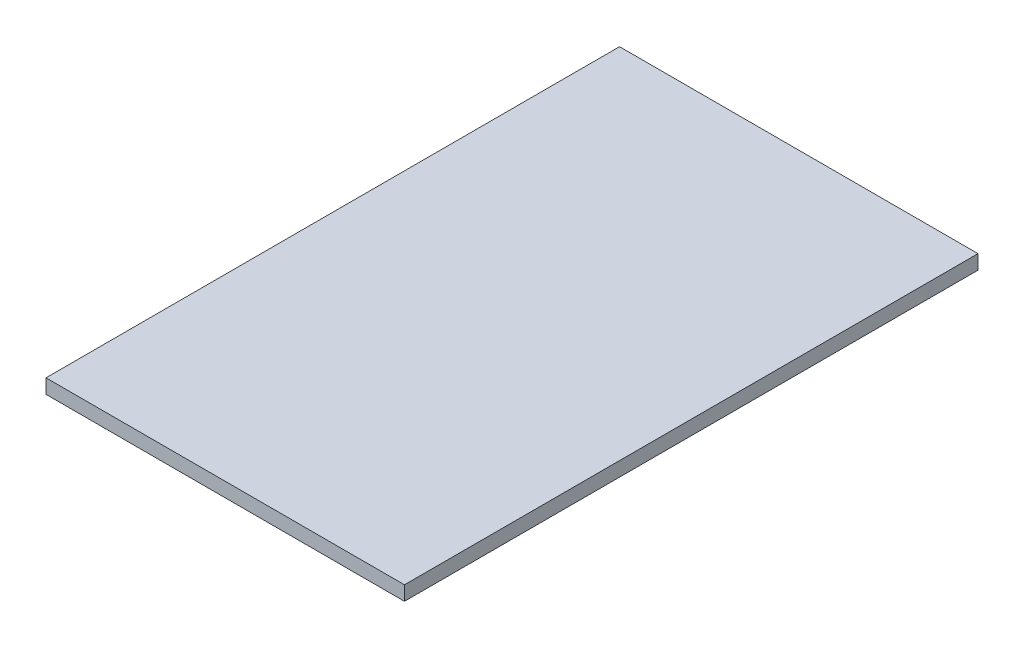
ISO-10303-21;
HEADER;
FILE_DESCRIPTION(('STEP AP214'),'2;1');
FILE_NAME('part.step','',(''),(''),'','','');
FILE_SCHEMA(('AUTOMOTIVE_DESIGN { 1 0 10303 214 1 1 1 1 }'));
ENDSEC;
DATA;
#1=APPLICATION_CONTEXT('core data for automotive mechanical design processes');
#2=APPLICATION_PROTOCOL_DEFINITION('international standard','automotive_design',2000,#1);
#3=PRODUCT_CONTEXT('',#1,'mechanical');
#4=PRODUCT('Part','Part','',(#3));
#5=PRODUCT_RELATED_PRODUCT_CATEGORY('part','',(#4));
#6=PRODUCT_DEFINITION_FORMATION('','',#4);
#7=PRODUCT_DEFINITION_CONTEXT('part definition',#1,'design');
#8=PRODUCT_DEFINITION('design','',#6,#7);
#9=PRODUCT_DEFINITION_SHAPE('','',#8);
#10=(LENGTH_UNIT() NAMED_UNIT(*) SI_UNIT(.MILLI.,.METRE.));
#11=(NAMED_UNIT(*) PLANE_ANGLE_UNIT() SI_UNIT($,.RADIAN.));
#12=(NAMED_UNIT(*) SI_UNIT($,.STERADIAN.) SOLID_ANGLE_UNIT());
#13=UNCERTAINTY_MEASURE_WITH_UNIT(LENGTH_MEASURE(1.E-05),#10,'distance_accuracy_value','');
#14=(GEOMETRIC_REPRESENTATION_CONTEXT(3) GLOBAL_UNCERTAINTY_ASSIGNED_CONTEXT((#13)) GLOBAL_UNIT_ASSIGNED_CONTEXT((#10,
#11,#12)) REPRESENTATION_CONTEXT('',''));
#15=CARTESIAN_POINT('',(0.,0.,0.));
#16=DIRECTION('',(0.,0.,1.));
#17=DIRECTION('',(1.,0.,0.));
#18=AXIS2_PLACEMENT_3D('',#15,#16,#17);
#19=CARTESIAN_POINT('',(0.,2.54,0.));
#20=DIRECTION('',(1.,0.,0.));
#21=DIRECTION('',(0.,0.,-1.));
#22=AXIS2_PLACEMENT_3D('',#19,#20,#21);
#23=PLANE('',#22);
#24=DIRECTION('',(0.,0.,1.));
#25=VECTOR('',#24,1.);
#26=CARTESIAN_POINT('',(0.,0.,0.));
#27=LINE('',#26,#25);
#28=CARTESIAN_POINT('',(0.,0.,-101.6));
#29=VERTEX_POINT('',#28);
#30=CARTESIAN_POINT('',(0.,0.,0.));
#31=VERTEX_POINT('',#30);
#32=EDGE_CURVE('E111',#29,#31,#27,.T.);
#33=ORIENTED_EDGE('',*,*,#32,.T.);
#34=DIRECTION('',(0.,-1.,0.));
#35=VECTOR('',#34,1.);
#36=CARTESIAN_POINT('',(0.,2.54,0.));
#37=LINE('',#36,#35);
#38=CARTESIAN_POINT('',(0.,2.54,0.));
#39=VERTEX_POINT('',#38);
#40=EDGE_CURVE('E11',#39,#31,#37,.T.);
#41=ORIENTED_EDGE('',*,*,#40,.F.);
#42=DIRECTION('',(0.,0.,1.));
#43=VECTOR('',#42,1.);
#44=CARTESIAN_POINT('',(0.,2.54,0.));
#45=LINE('',#44,#43);
#46=CARTESIAN_POINT('',(0.,2.54,-101.6));
#47=VERTEX_POINT('',#46);
#48=EDGE_CURVE('E95',#47,#39,#45,.T.);
#49=ORIENTED_EDGE('',*,*,#48,.F.);
#50=DIRECTION('',(0.,-1.,0.));
#51=VECTOR('',#50,1.);
#52=CARTESIAN_POINT('',(0.,2.54,-101.6));
#53=LINE('',#52,#51);
#54=EDGE_CURVE('E107',#47,#29,#53,.T.);
#55=ORIENTED_EDGE('',*,*,#54,.T.);
#56=EDGE_LOOP('',(#33,#41,#49,#55));
#57=FACE_BOUND('',#56,.T.);
#58=ADVANCED_FACE('F43',(#57),#23,.F.);
#59=CARTESIAN_POINT('',(0.,2.54,0.));
#60=DIRECTION('',(0.,0.,-1.));
#61=DIRECTION('',(-1.,0.,0.));
#62=AXIS2_PLACEMENT_3D('',#59,#60,#61);
#63=PLANE('',#62);
#64=DIRECTION('',(1.,0.,0.));
#65=VECTOR('',#64,1.);
#66=CARTESIAN_POINT('',(0.,0.,0.));
#67=LINE('',#66,#65);
#68=CARTESIAN_POINT('',(63.5,0.,0.));
#69=VERTEX_POINT('',#68);
#70=EDGE_CURVE('E100',#31,#69,#67,.T.);
#71=ORIENTED_EDGE('',*,*,#70,.T.);
#72=DIRECTION('',(0.,-1.,0.));
#73=VECTOR('',#72,1.);
#74=CARTESIAN_POINT('',(63.5,2.54,0.));
#75=LINE('',#74,#73);
#76=CARTESIAN_POINT('',(63.5,2.54,0.));
#77=VERTEX_POINT('',#76);
#78=EDGE_CURVE('E52',#77,#69,#75,.T.);
#79=ORIENTED_EDGE('',*,*,#78,.F.);
#80=DIRECTION('',(1.,0.,0.));
#81=VECTOR('',#80,1.);
#82=CARTESIAN_POINT('',(0.,2.54,0.));
#83=LINE('',#82,#81);
#84=EDGE_CURVE('E90',#39,#77,#83,.T.);
#85=ORIENTED_EDGE('',*,*,#84,.F.);
#86=ORIENTED_EDGE('',*,*,#40,.T.);
#87=EDGE_LOOP('',(#71,#79,#85,#86));
#88=FACE_BOUND('',#87,.T.);
#89=ADVANCED_FACE('F99',(#88),#63,.F.);
#90=CARTESIAN_POINT('',(63.5,2.54,0.));
#91=DIRECTION('',(-1.,0.,0.));
#92=DIRECTION('',(0.,0.,1.));
#93=AXIS2_PLACEMENT_3D('',#90,#91,#92);
#94=PLANE('',#93);
#95=DIRECTION('',(0.,0.,-1.));
#96=VECTOR('',#95,1.);
#97=CARTESIAN_POINT('',(63.5,0.,0.));
#98=LINE('',#97,#96);
#99=CARTESIAN_POINT('',(63.5,0.,-101.6));
#100=VERTEX_POINT('',#99);
#101=EDGE_CURVE('E77',#69,#100,#98,.T.);
#102=ORIENTED_EDGE('',*,*,#101,.T.);
#103=DIRECTION('',(0.,-1.,0.));
#104=VECTOR('',#103,1.);
#105=CARTESIAN_POINT('',(63.5,2.54,-101.6));
#106=LINE('',#105,#104);
#107=CARTESIAN_POINT('',(63.5,2.54,-101.6));
#108=VERTEX_POINT('',#107);
#109=EDGE_CURVE('E102',#108,#100,#106,.T.);
#110=ORIENTED_EDGE('',*,*,#109,.F.);
#111=DIRECTION('',(0.,0.,-1.));
#112=VECTOR('',#111,1.);
#113=CARTESIAN_POINT('',(63.5,2.54,0.));
#114=LINE('',#113,#112);
#115=EDGE_CURVE('E93',#77,#108,#114,.T.);
#116=ORIENTED_EDGE('',*,*,#115,.F.);
#117=ORIENTED_EDGE('',*,*,#78,.T.);
#118=EDGE_LOOP('',(#102,#110,#116,#117));
#119=FACE_BOUND('',#118,.T.);
#120=ADVANCED_FACE('F103',(#119),#94,.F.);
#121=CARTESIAN_POINT('',(0.,2.54,-101.6));
#122=DIRECTION('',(0.,0.,1.));
#123=DIRECTION('',(1.,0.,0.));
#124=AXIS2_PLACEMENT_3D('',#121,#122,#123);
#125=PLANE('',#124);
#126=DIRECTION('',(-1.,0.,0.));
#127=VECTOR('',#126,1.);
#128=CARTESIAN_POINT('',(0.,0.,-101.6));
#129=LINE('',#128,#127);
#130=EDGE_CURVE('E83',#100,#29,#129,.T.);
#131=ORIENTED_EDGE('',*,*,#130,.T.);
#132=ORIENTED_EDGE('',*,*,#54,.F.);
#133=DIRECTION('',(-1.,0.,0.));
#134=VECTOR('',#133,1.);
#135=CARTESIAN_POINT('',(0.,2.54,-101.6));
#136=LINE('',#135,#134);
#137=EDGE_CURVE('E60',#108,#47,#136,.T.);
#138=ORIENTED_EDGE('',*,*,#137,.F.);
#139=ORIENTED_EDGE('',*,*,#109,.T.);
#140=EDGE_LOOP('',(#131,#132,#138,#139));
#141=FACE_BOUND('',#140,.T.);
#142=ADVANCED_FACE('F124',(#141),#125,.F.);
#143=CARTESIAN_POINT('',(0.,2.54,0.));
#144=DIRECTION('',(0.,-1.,0.));
#145=DIRECTION('',(0.,0.,-1.));
#146=AXIS2_PLACEMENT_3D('',#143,#144,#145);
#147=PLANE('',#146);
#148=ORIENTED_EDGE('',*,*,#48,.T.);
#149=ORIENTED_EDGE('',*,*,#84,.T.);
#150=ORIENTED_EDGE('',*,*,#115,.T.);
#151=ORIENTED_EDGE('',*,*,#137,.T.);
#152=EDGE_LOOP('',(#148,#149,#150,#151));
#153=FACE_BOUND('',#152,.T.);
#154=ADVANCED_FACE('F91',(#153),#147,.F.);
#155=CARTESIAN_POINT('',(0.,0.,0.));
#156=DIRECTION('',(0.,-1.,0.));
#157=DIRECTION('',(0.,0.,-1.));
#158=AXIS2_PLACEMENT_3D('',#155,#156,#157);
#159=PLANE('',#158);
#160=ORIENTED_EDGE('',*,*,#32,.F.);
#161=ORIENTED_EDGE('',*,*,#130,.F.);
#162=ORIENTED_EDGE('',*,*,#101,.F.);
#163=ORIENTED_EDGE('',*,*,#70,.F.);
#164=EDGE_LOOP('',(#160,#161,#162,#163));
#165=FACE_BOUND('',#164,.T.);
#166=ADVANCED_FACE('F127',(#165),#159,.T.);
#167=CLOSED_SHELL('',(#58,#89,#120,#142,#154,#166));
#168=MANIFOLD_SOLID_BREP('B2',#167);
#169=ADVANCED_BREP_SHAPE_REPRESENTATION('',(#18,#168),#14);
#170=SHAPE_DEFINITION_REPRESENTATION(#9,#169);
ENDSEC;
END-ISO-10303-21;
